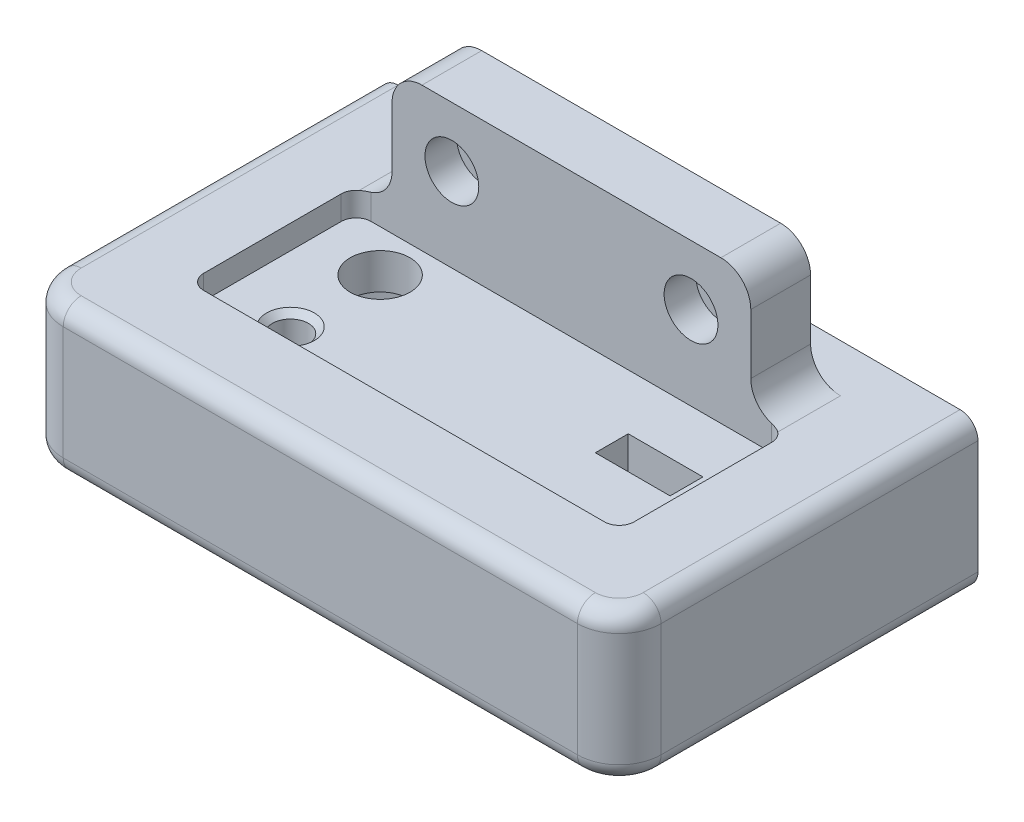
from build123d import *

# Parameters (mm, degrees)
SKETCH1_W           = 100
SKETCH1_H           = 25
BOSS_EXTRUDE1_DEPTH = 60
SKETCH5_W           = 60
SKETCH5_H           = 10
BOSS_EXTRUDE2_DEPTH = 20
SKETCH6_R           = 3
CUT_EXTRUDE2_DEPTH  = 10
CUT_EXTRUDE3_DEPTH  = 126
FILLET1_R           = 3
SKETCH8_R           = 20
CUT_EXTRUDE4_DEPTH  = 15
SKETCH9_R           = 4.5
CUT_EXTRUDE5_DEPTH  = 5.3
SKETCH10_R          = 5
SKETCH10_R_2        = 3
SKETCH10_W          = 12.5
SKETCH10_H          = 5.5
CUT_EXTRUDE6_DEPTH  = 10
CUT_EXTRUDE7_DEPTH  = 4
CHAMFER2_SIZE       = 1
REDONDEO1_R         = 5


with BuildPart() as part:
    # Sketch1 → Boss-Extrude1 (new body)
    with BuildSketch(Plane.XY):
        with Locations((50, 12.5)):
            Rectangle(SKETCH1_W, SKETCH1_H)
    extrude(amount=BOSS_EXTRUDE1_DEPTH)

    # Sketch5 → Boss-Extrude2 (add)
    with BuildSketch(Plane(origin=(0, 25, 0), x_dir=(1, 0, 0), z_dir=(0, 1, 0))):
        with Locations((50, -13)):
            Rectangle(SKETCH5_W, SKETCH5_H)
    extrude(amount=BOSS_EXTRUDE2_DEPTH)

    # Sketch6 → Cut-Extrude2 (cut)
    with BuildSketch(Plane(origin=(0, 0, 8), x_dir=(-1, 0, 0), z_dir=(0, 0, -1))):
        with Locations((-70, 35)):
            Circle(SKETCH6_R)
        with Locations((-30, 35)):
            Circle(SKETCH6_R)
    extrude(amount=-CUT_EXTRUDE2_DEPTH, mode=Mode.SUBTRACT)

    # Sketch7 → Cut-Extrude3 (cut, through all)
    with BuildSketch(Plane.XZ):
        with BuildLine():
            Line((0, 60), (0, 53))
            ThreePointArc((0, 53), (2.050252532, 57.949747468), (7, 60))
            Line((7, 60), (0, 60))
        make_face()
        with BuildLine():
            Line((100, 60), (93, 60))
            ThreePointArc((93, 60), (97.949747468, 57.949747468), (100, 53))
            Line((100, 53), (100, 60))
        make_face()
    extrude(amount=-CUT_EXTRUDE3_DEPTH, mode=Mode.SUBTRACT)

    # Fillet1
    fillet1_edges = [part.edges().sort_by_distance(p)[0] for p in [
        (50, 0, 60),
        (50, 25, 60),
        (100, 25, 26.5),
        (100, 0, 26.5),
        (0, 0, 26.5),
        (0, 25, 26.5),
        (2.050252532, 25, 57.949747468),
        (2.050252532, 0, 57.949747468),
        (97.949747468, 25, 57.949747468),
        (97.949747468, 0, 57.949747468),
    ]]
    fillet(fillet1_edges, radius=FILLET1_R)

    # Sketch8 → Cut-Extrude4 (cut)
    with BuildSketch(Plane.XZ):
        with Locations(Location((25, 30, 0), (0, 0, 270))):
            Circle(SKETCH8_R)
        with Locations(Location((75, 30, 0), (0, 0, 270))):
            Circle(SKETCH8_R)
    extrude(amount=-CUT_EXTRUDE4_DEPTH, mode=Mode.SUBTRACT)

    # Sketch9 → Cut-Extrude5 (cut)
    with BuildSketch(Plane.XY.offset(18)):
        with Locations((30, 35)):
            Circle(SKETCH9_R)
        with Locations((70, 35)):
            Circle(SKETCH9_R)
    extrude(amount=-CUT_EXTRUDE5_DEPTH, mode=Mode.SUBTRACT)

    # Sketch10 → Cut-Extrude6 (cut)
    with BuildSketch(Plane.XZ.offset(-15)):
        with Locations(Location((25, 25, 0), (0, 0, 90))):
            Circle(SKETCH10_R)
        with Locations(Location((25, 40, 0), (0, 0, 90))):
            Circle(SKETCH10_R_2)
        with Locations((75, 30)):
            Rectangle(SKETCH10_W, SKETCH10_H)
    extrude(amount=-CUT_EXTRUDE6_DEPTH, mode=Mode.SUBTRACT)

    # Sketch11 → Cut-Extrude7 (cut)
    with BuildSketch(Plane(origin=(0, 25, 0), x_dir=(1, 0, 0), z_dir=(0, 1, 0))):
        with BuildLine():
            Line((16.5, -46), (83.5, -46))
            ThreePointArc((83.5, -46), (85.267766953, -45.267766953), (86, -43.5))
            Line((86, -43.5), (86, -20.5))
            ThreePointArc((86, -20.5), (85.267766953, -18.732233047), (83.5, -18))
            Line((83.5, -18), (16.5, -18))
            ThreePointArc((16.5, -18), (14.732233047, -18.732233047), (14, -20.5))
            Line((14, -20.5), (14, -43.5))
            ThreePointArc((14, -43.5), (14.732233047, -45.267766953), (16.5, -46))
        make_face()
    extrude(amount=-CUT_EXTRUDE7_DEPTH, mode=Mode.SUBTRACT)

    # Chamfer2
    chamfer2_edges = [part.edges().sort_by_distance(p)[0] for p in [
        (25, 21, 37),
    ]]
    chamfer(chamfer2_edges, length=CHAMFER2_SIZE)

    # Redondeo1
    redondeo1_edges = [part.edges().sort_by_distance(p)[0] for p in [
        (20, 25, 13),
        (20, 45, 13),
        (80, 45, 13),
        (80, 25, 13),
    ]]
    fillet(redondeo1_edges, radius=REDONDEO1_R)


solid = part.part
